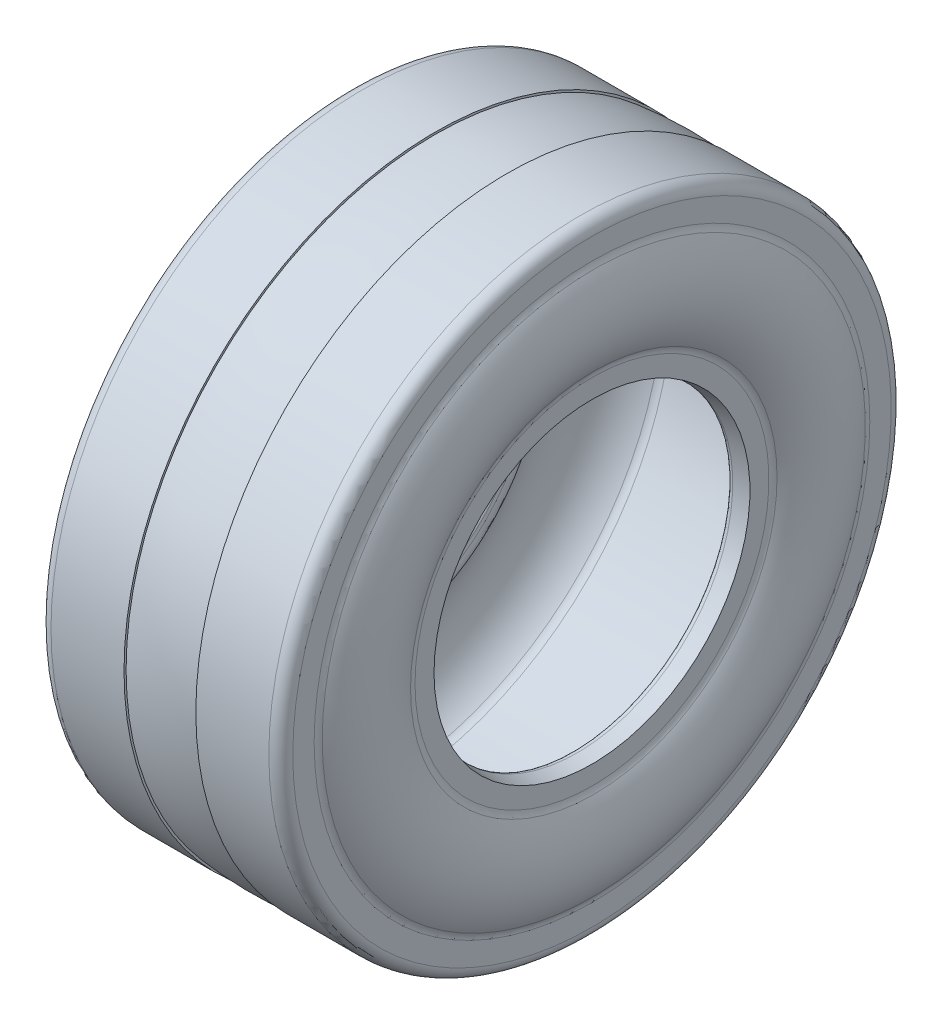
from build123d import *


with BuildPart() as part:
    # Esquisse1 → Base-R_volution (revolve)
    with BuildSketch(Plane(origin=(80, -50, 0), x_dir=(1, 0, 0), z_dir=(0, 0, 1)), mode=Mode.PRIVATE) as base_r_volution_sk:
        with BuildLine():
            Line((-67.645855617, 20), (-37.145855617, 20))
            Line((-37.145855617, 20), (-37.145855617, 19.131715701))
            ThreePointArc((-37.145855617, 19.131715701), (-22.145855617, 20), (-7.145855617, 19.131715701))
            Line((-7.145855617, 19.131715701), (-7.145855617, 20))
            Line((-7.145855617, 20), (23.354144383, 20))
            ThreePointArc((23.354144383, 20), (26.889678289, 18.535533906), (28.354144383, 15))
            Line((28.354144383, 15), (28.354144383, 6.071307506))
            ThreePointArc((28.354144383, 6.071307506), (28.545298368, 4.702001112), (29.104144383, 3.437394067))
            ThreePointArc((29.104144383, 3.437394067), (34.354144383, -15), (29.104144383, -33.437394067))
            ThreePointArc((29.104144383, -33.437394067), (28.545298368, -34.702001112), (28.354144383, -36.071307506))
            Line((28.354144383, -36.071307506), (28.354144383, -44))
            Line((28.354144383, -44), (22.158088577, -44.984130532))
            ThreePointArc((22.158088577, -44.984130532), (20.791226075, -44.709159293), (19.936165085, -43.607890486))
            Line((19.936165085, -43.607890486), (19.563474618, -42.420636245))
            ThreePointArc((19.563474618, -42.420636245), (19.489245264, -39.686699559), (20.864537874, -37.322700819))
            ThreePointArc((20.864537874, -37.322700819), (30.28218399, -12.888989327), (17.631875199, 10.038461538))
            ThreePointArc((17.631875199, 10.038461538), (16.234288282, 10.75354119), (14.6838541, 11))
            Line((14.6838541, 11), (-58.975565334, 11))
            ThreePointArc((-58.975565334, 11), (-60.525999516, 10.75354119), (-61.923586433, 10.038461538))
            ThreePointArc((-61.923586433, 10.038461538), (-74.573895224, -12.888989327), (-65.156249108, -37.322700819))
            ThreePointArc((-65.156249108, -37.322700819), (-63.780956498, -39.686699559), (-63.855185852, -42.420636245))
            Line((-63.855185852, -42.420636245), (-64.227876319, -43.607890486))
            ThreePointArc((-64.227876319, -43.607890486), (-65.082937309, -44.709159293), (-66.449799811, -44.984130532))
            Line((-66.449799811, -44.984130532), (-72.645855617, -44))
            Line((-72.645855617, -44), (-72.645855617, -36.071307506))
            ThreePointArc((-72.645855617, -36.071307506), (-72.837009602, -34.702001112), (-73.395855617, -33.437394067))
            ThreePointArc((-73.395855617, -33.437394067), (-78.645855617, -15), (-73.395855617, 3.437394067))
            ThreePointArc((-73.395855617, 3.437394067), (-72.837009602, 4.702001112), (-72.645855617, 6.071307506))
            Line((-72.645855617, 6.071307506), (-72.645855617, 15))
            ThreePointArc((-72.645855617, 15), (-71.181389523, 18.535533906), (-67.645855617, 20))
        make_face()
    revolve(base_r_volution_sk.sketch.rotate(Axis((0, -160, 0), (1, 0, 0)), 90), axis=Axis((0, -160, 0), (1, 0, 0)))


solid = part.part
